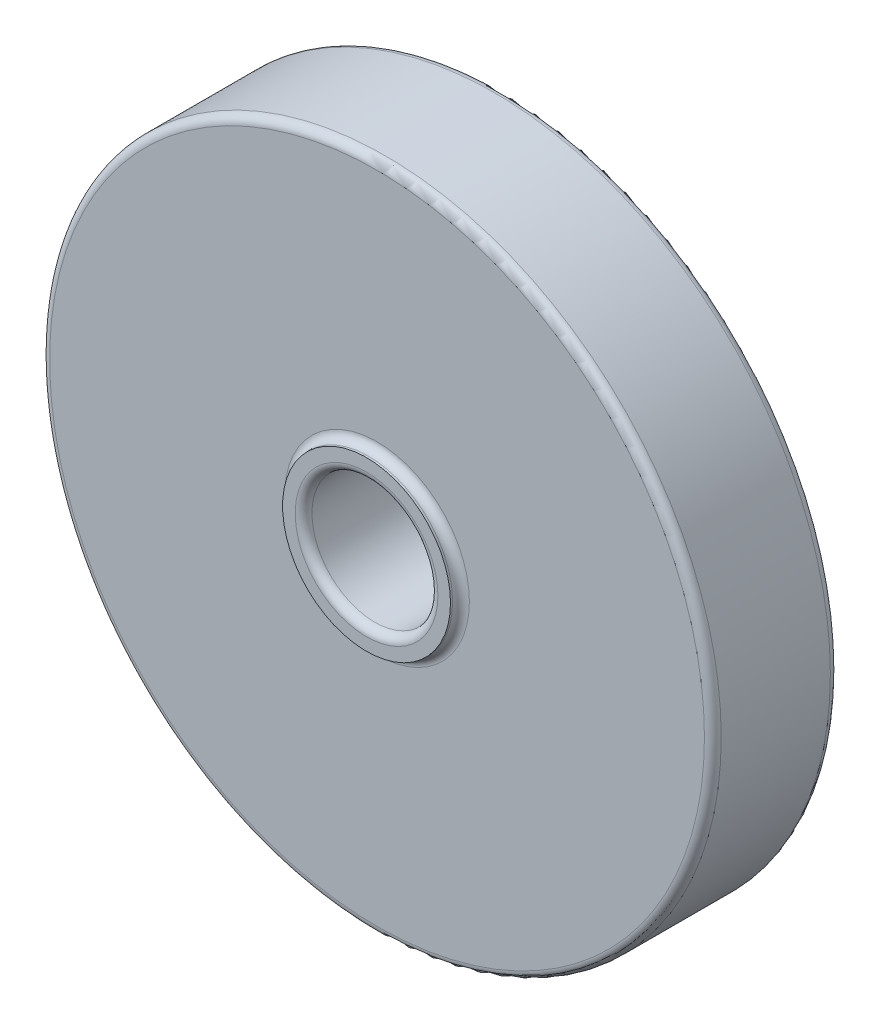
from build123d import *

# Parameters (mm, degrees)
ESQUISSE1_R      = 8
ESQUISSE1_R_2    = 1.5
EXTRUSION1_DEPTH = 3
ESQUISSE2_R      = 2
ESQUISSE2_R_2    = 1.5
EXTRUSION2_DEPTH = 0.25
CONG_1_R         = 0.2


with BuildPart() as part:
    # Esquisse1 → Extrusion1 (new body)
    with BuildSketch(Plane.XY):
        Circle(ESQUISSE1_R)
        Circle(ESQUISSE1_R_2, mode=Mode.SUBTRACT)
    extrude(amount=EXTRUSION1_DEPTH)

    # Esquisse2 → Extrusion2 (add)
    with BuildSketch(Plane.XY.offset(3)):
        Circle(ESQUISSE2_R)
        Circle(ESQUISSE2_R_2, mode=Mode.SUBTRACT)
    extrude(amount=EXTRUSION2_DEPTH)

    # Cong_1
    cong_1_edges = [part.edges().sort_by_distance(p)[0] for p in [
        (-8, 0, 0),
        (-8, 0, 3),
        (-2, 0, 3),
        (-1.5, 0, 3.25),
        (-1.5, 0, 0),
    ]]
    fillet(cong_1_edges, radius=CONG_1_R)


solid = part.part
